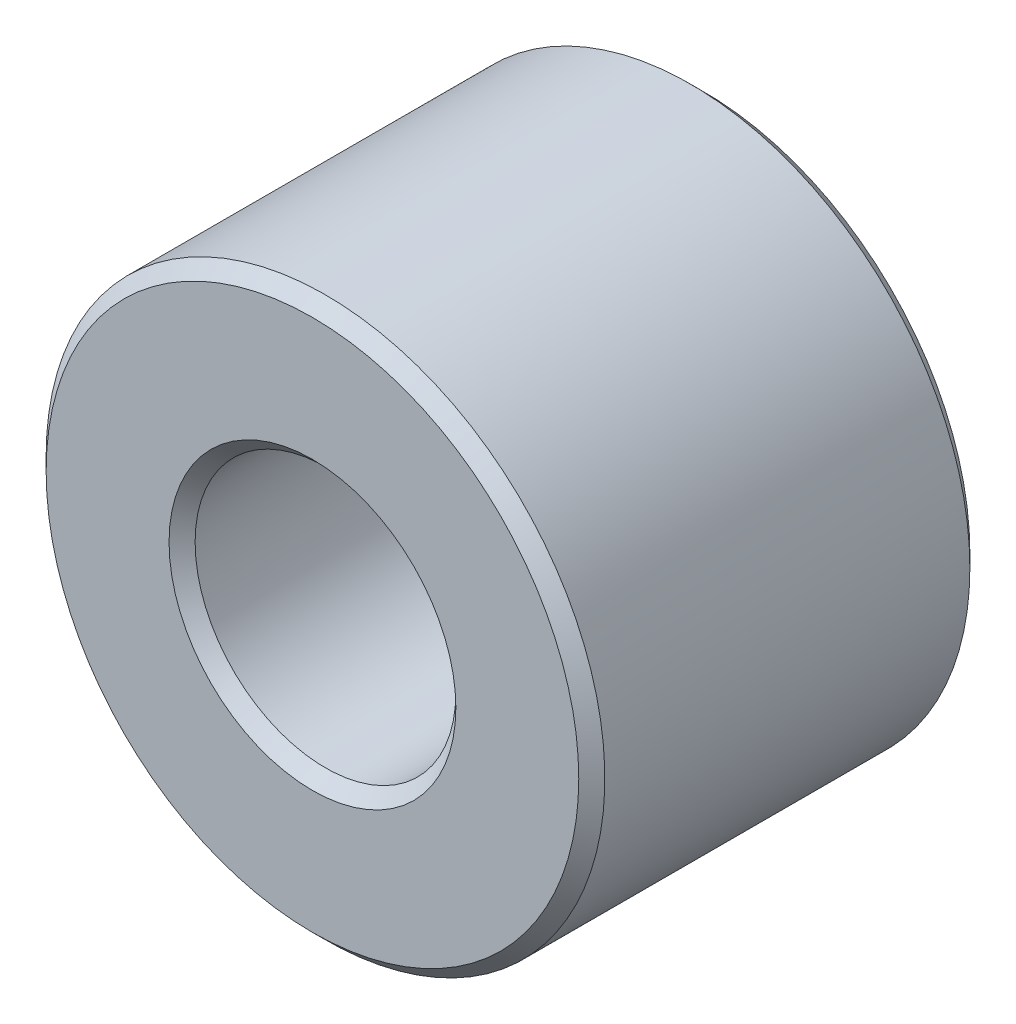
from build123d import *

# Parameters (mm, degrees)
SKETCH1_R           = 15
SKETCH1_R_2         = 7
BOSS_EXTRUDE1_DEPTH = 10.5
CHAMFER1_SIZE       = 0.7


with BuildPart() as part:
    # Sketch1 → Boss-Extrude1 (new, symmetric)
    with BuildSketch(Plane.XY):
        with Locations(Location((0, 0, 0), (0, 0, 180))):
            Circle(SKETCH1_R)
        with Locations(Location((0, 0, 0), (0, 0, 180))):
            Circle(SKETCH1_R_2, mode=Mode.SUBTRACT)
    extrude(amount=BOSS_EXTRUDE1_DEPTH, both=True)

    # Chamfer1
    chamfer1_edges = [part.edges().sort_by_distance(p)[0] for p in [
        (15, 0, -10.5),
        (15, 0, 10.5),
        (7, 0, -10.5),
        (7, 0, 10.5),
    ]]
    chamfer(chamfer1_edges, length=CHAMFER1_SIZE)


solid = part.part
